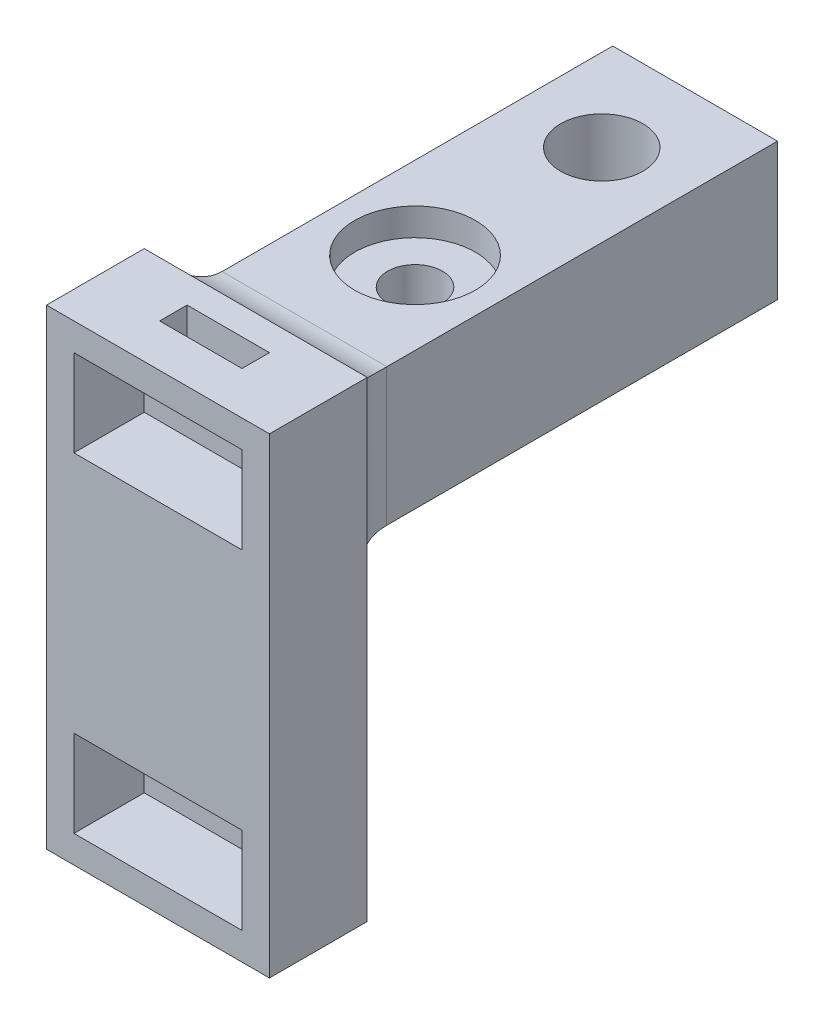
ISO-10303-21;
HEADER;
FILE_DESCRIPTION(('STEP AP214'),'2;1');
FILE_NAME('part.step','',(''),(''),'','','');
FILE_SCHEMA(('AUTOMOTIVE_DESIGN { 1 0 10303 214 1 1 1 1 }'));
ENDSEC;
DATA;
#1=APPLICATION_CONTEXT('core data for automotive mechanical design processes');
#2=APPLICATION_PROTOCOL_DEFINITION('international standard','automotive_design',2000,#1);
#3=PRODUCT_CONTEXT('',#1,'mechanical');
#4=PRODUCT('Part','Part','',(#3));
#5=PRODUCT_RELATED_PRODUCT_CATEGORY('part','',(#4));
#6=PRODUCT_DEFINITION_FORMATION('','',#4);
#7=PRODUCT_DEFINITION_CONTEXT('part definition',#1,'design');
#8=PRODUCT_DEFINITION('design','',#6,#7);
#9=PRODUCT_DEFINITION_SHAPE('','',#8);
#10=(LENGTH_UNIT() NAMED_UNIT(*) SI_UNIT(.MILLI.,.METRE.));
#11=(NAMED_UNIT(*) PLANE_ANGLE_UNIT() SI_UNIT($,.RADIAN.));
#12=(NAMED_UNIT(*) SI_UNIT($,.STERADIAN.) SOLID_ANGLE_UNIT());
#13=UNCERTAINTY_MEASURE_WITH_UNIT(LENGTH_MEASURE(1.E-05),#10,'distance_accuracy_value','');
#14=(GEOMETRIC_REPRESENTATION_CONTEXT(3) GLOBAL_UNCERTAINTY_ASSIGNED_CONTEXT((#13)) GLOBAL_UNIT_ASSIGNED_CONTEXT((#10,
#11,#12)) REPRESENTATION_CONTEXT('',''));
#15=CARTESIAN_POINT('',(0.,0.,0.));
#16=DIRECTION('',(0.,0.,1.));
#17=DIRECTION('',(1.,0.,0.));
#18=AXIS2_PLACEMENT_3D('',#15,#16,#17);
#19=CARTESIAN_POINT('',(0.,-42.5,-29.));
#20=DIRECTION('',(0.,1.,0.));
#21=DIRECTION('',(0.,0.,1.));
#22=AXIS2_PLACEMENT_3D('',#19,#20,#21);
#23=CYLINDRICAL_SURFACE('',#22,5.);
#24=CARTESIAN_POINT('',(0.,12.5,-29.));
#25=DIRECTION('',(0.,1.,0.));
#26=DIRECTION('',(-1.,0.,0.));
#27=AXIS2_PLACEMENT_3D('',#24,#25,#26);
#28=CIRCLE('',#27,5.);
#29=CARTESIAN_POINT('',(-5.,12.5,-29.));
#30=VERTEX_POINT('',#29);
#31=EDGE_CURVE('E312',#30,#30,#28,.T.);
#32=ORIENTED_EDGE('',*,*,#31,.F.);
#33=EDGE_LOOP('',(#32));
#34=FACE_BOUND('',#33,.T.);
#35=CARTESIAN_POINT('',(0.,32.5,-29.));
#36=DIRECTION('',(0.,1.,0.));
#37=DIRECTION('',(0.,0.,1.));
#38=AXIS2_PLACEMENT_3D('',#35,#36,#37);
#39=CIRCLE('',#38,5.);
#40=CARTESIAN_POINT('',(0.,32.5,-24.));
#41=VERTEX_POINT('',#40);
#42=EDGE_CURVE('E518',#41,#41,#39,.T.);
#43=ORIENTED_EDGE('',*,*,#42,.T.);
#44=EDGE_LOOP('',(#43));
#45=FACE_BOUND('',#44,.T.);
#46=ADVANCED_FACE('F43',(#34,#45),#23,.F.);
#47=CARTESIAN_POINT('',(0.,0.,0.));
#48=DIRECTION('',(0.,0.,-1.));
#49=DIRECTION('',(-1.,0.,0.));
#50=AXIS2_PLACEMENT_3D('',#47,#48,#49);
#51=PLANE('',#50);
#52=DIRECTION('',(-1.,0.,0.));
#53=VECTOR('',#52,1.);
#54=CARTESIAN_POINT('',(15.,12.5,0.));
#55=LINE('',#54,#53);
#56=CARTESIAN_POINT('',(20.3,12.5,0.));
#57=VERTEX_POINT('',#56);
#58=CARTESIAN_POINT('',(-20.3,12.5,0.));
#59=VERTEX_POINT('',#58);
#60=EDGE_CURVE('E316',#57,#59,#55,.T.);
#61=ORIENTED_EDGE('',*,*,#60,.F.);
#62=DIRECTION('',(0.,1.,0.));
#63=VECTOR('',#62,1.);
#64=CARTESIAN_POINT('',(20.3,-42.9,0.));
#65=LINE('',#64,#63);
#66=CARTESIAN_POINT('',(20.3,-42.9,0.));
#67=VERTEX_POINT('',#66);
#68=EDGE_CURVE('E287',#67,#57,#65,.T.);
#69=ORIENTED_EDGE('',*,*,#68,.F.);
#70=DIRECTION('',(1.,0.,0.));
#71=VECTOR('',#70,1.);
#72=CARTESIAN_POINT('',(-20.3,-42.9,0.));
#73=LINE('',#72,#71);
#74=CARTESIAN_POINT('',(-20.3,-42.9,0.));
#75=VERTEX_POINT('',#74);
#76=EDGE_CURVE('E280',#75,#67,#73,.T.);
#77=ORIENTED_EDGE('',*,*,#76,.F.);
#78=DIRECTION('',(0.,-1.,0.));
#79=VECTOR('',#78,1.);
#80=CARTESIAN_POINT('',(-20.3,-42.9,0.));
#81=LINE('',#80,#79);
#82=EDGE_CURVE('E292',#59,#75,#81,.T.);
#83=ORIENTED_EDGE('',*,*,#82,.F.);
#84=EDGE_LOOP('',(#61,#69,#77,#83));
#85=FACE_BOUND('',#84,.T.);
#86=ADVANCED_FACE('F354',(#85),#51,.T.);
#87=CARTESIAN_POINT('',(0.,0.,17.8));
#88=DIRECTION('',(0.,0.,-1.));
#89=DIRECTION('',(-1.,0.,0.));
#90=AXIS2_PLACEMENT_3D('',#87,#88,#89);
#91=PLANE('',#90);
#92=DIRECTION('',(0.,1.,0.));
#93=VECTOR('',#92,1.);
#94=CARTESIAN_POINT('',(15.3,-22.1,17.8));
#95=LINE('',#94,#93);
#96=CARTESIAN_POINT('',(15.3,-37.9,17.8));
#97=VERTEX_POINT('',#96);
#98=CARTESIAN_POINT('',(15.3,-22.1,17.8));
#99=VERTEX_POINT('',#98);
#100=EDGE_CURVE('E255',#97,#99,#95,.T.);
#101=ORIENTED_EDGE('',*,*,#100,.F.);
#102=DIRECTION('',(1.,0.,0.));
#103=VECTOR('',#102,1.);
#104=CARTESIAN_POINT('',(-15.3,-37.9,17.8));
#105=LINE('',#104,#103);
#106=CARTESIAN_POINT('',(-15.3,-37.9,17.8));
#107=VERTEX_POINT('',#106);
#108=EDGE_CURVE('E262',#107,#97,#105,.T.);
#109=ORIENTED_EDGE('',*,*,#108,.F.);
#110=DIRECTION('',(0.,-1.,0.));
#111=VECTOR('',#110,1.);
#112=CARTESIAN_POINT('',(-15.3,-22.1,17.8));
#113=LINE('',#112,#111);
#114=CARTESIAN_POINT('',(-15.3,-22.1,17.8));
#115=VERTEX_POINT('',#114);
#116=EDGE_CURVE('E259',#115,#107,#113,.T.);
#117=ORIENTED_EDGE('',*,*,#116,.F.);
#118=DIRECTION('',(-1.,0.,0.));
#119=VECTOR('',#118,1.);
#120=CARTESIAN_POINT('',(-15.3,-22.1,17.8));
#121=LINE('',#120,#119);
#122=EDGE_CURVE('E257',#99,#115,#121,.T.);
#123=ORIENTED_EDGE('',*,*,#122,.F.);
#124=EDGE_LOOP('',(#101,#109,#117,#123));
#125=FACE_BOUND('',#124,.T.);
#126=DIRECTION('',(0.,1.,0.));
#127=VECTOR('',#126,1.);
#128=CARTESIAN_POINT('',(20.3,-42.9,17.8));
#129=LINE('',#128,#127);
#130=CARTESIAN_POINT('',(20.3,-42.9,17.8));
#131=VERTEX_POINT('',#130);
#132=CARTESIAN_POINT('',(20.3,42.9,17.8));
#133=VERTEX_POINT('',#132);
#134=EDGE_CURVE('E276',#131,#133,#129,.T.);
#135=ORIENTED_EDGE('',*,*,#134,.T.);
#136=DIRECTION('',(-1.,0.,0.));
#137=VECTOR('',#136,1.);
#138=CARTESIAN_POINT('',(-20.3,42.9,17.8));
#139=LINE('',#138,#137);
#140=CARTESIAN_POINT('',(-20.3,42.9,17.8));
#141=VERTEX_POINT('',#140);
#142=EDGE_CURVE('E279',#133,#141,#139,.T.);
#143=ORIENTED_EDGE('',*,*,#142,.T.);
#144=DIRECTION('',(0.,-1.,0.));
#145=VECTOR('',#144,1.);
#146=CARTESIAN_POINT('',(-20.3,-42.9,17.8));
#147=LINE('',#146,#145);
#148=CARTESIAN_POINT('',(-20.3,-42.9,17.8));
#149=VERTEX_POINT('',#148);
#150=EDGE_CURVE('E282',#141,#149,#147,.T.);
#151=ORIENTED_EDGE('',*,*,#150,.T.);
#152=DIRECTION('',(1.,0.,0.));
#153=VECTOR('',#152,1.);
#154=CARTESIAN_POINT('',(-20.3,-42.9,17.8));
#155=LINE('',#154,#153);
#156=EDGE_CURVE('E284',#149,#131,#155,.T.);
#157=ORIENTED_EDGE('',*,*,#156,.T.);
#158=EDGE_LOOP('',(#135,#143,#151,#157));
#159=FACE_BOUND('',#158,.T.);
#160=DIRECTION('',(0.,-1.,0.));
#161=VECTOR('',#160,1.);
#162=CARTESIAN_POINT('',(-15.3,22.1,17.8));
#163=LINE('',#162,#161);
#164=CARTESIAN_POINT('',(-15.3,37.9,17.8));
#165=VERTEX_POINT('',#164);
#166=CARTESIAN_POINT('',(-15.3,22.1,17.8));
#167=VERTEX_POINT('',#166);
#168=EDGE_CURVE('E236',#165,#167,#163,.T.);
#169=ORIENTED_EDGE('',*,*,#168,.F.);
#170=DIRECTION('',(-1.,0.,0.));
#171=VECTOR('',#170,1.);
#172=CARTESIAN_POINT('',(-15.3,37.9,17.8));
#173=LINE('',#172,#171);
#174=CARTESIAN_POINT('',(15.3,37.9,17.8));
#175=VERTEX_POINT('',#174);
#176=EDGE_CURVE('E243',#175,#165,#173,.T.);
#177=ORIENTED_EDGE('',*,*,#176,.F.);
#178=DIRECTION('',(0.,1.,0.));
#179=VECTOR('',#178,1.);
#180=CARTESIAN_POINT('',(15.3,22.1,17.8));
#181=LINE('',#180,#179);
#182=CARTESIAN_POINT('',(15.3,22.1,17.8));
#183=VERTEX_POINT('',#182);
#184=EDGE_CURVE('E240',#183,#175,#181,.T.);
#185=ORIENTED_EDGE('',*,*,#184,.F.);
#186=DIRECTION('',(1.,0.,0.));
#187=VECTOR('',#186,1.);
#188=CARTESIAN_POINT('',(-15.3,22.1,17.8));
#189=LINE('',#188,#187);
#190=EDGE_CURVE('E238',#167,#183,#189,.T.);
#191=ORIENTED_EDGE('',*,*,#190,.F.);
#192=EDGE_LOOP('',(#169,#177,#185,#191));
#193=FACE_BOUND('',#192,.T.);
#194=ADVANCED_FACE('F360',(#125,#159,#193),#91,.F.);
#195=CARTESIAN_POINT('',(20.3,-42.9,17.8));
#196=DIRECTION('',(-1.,0.,0.));
#197=DIRECTION('',(0.,0.,1.));
#198=AXIS2_PLACEMENT_3D('',#195,#196,#197);
#199=PLANE('',#198);
#200=ORIENTED_EDGE('',*,*,#68,.T.);
#201=CARTESIAN_POINT('',(20.3,42.9,0.));
#202=VERTEX_POINT('',#201);
#203=EDGE_CURVE('E275',#57,#202,#65,.T.);
#204=ORIENTED_EDGE('',*,*,#203,.T.);
#205=DIRECTION('',(0.,0.,-1.));
#206=VECTOR('',#205,1.);
#207=CARTESIAN_POINT('',(20.3,42.9,17.8));
#208=LINE('',#207,#206);
#209=EDGE_CURVE('E305',#133,#202,#208,.T.);
#210=ORIENTED_EDGE('',*,*,#209,.F.);
#211=ORIENTED_EDGE('',*,*,#134,.F.);
#212=DIRECTION('',(0.,0.,-1.));
#213=VECTOR('',#212,1.);
#214=CARTESIAN_POINT('',(20.3,-42.9,17.8));
#215=LINE('',#214,#213);
#216=EDGE_CURVE('E286',#131,#67,#215,.T.);
#217=ORIENTED_EDGE('',*,*,#216,.T.);
#218=EDGE_LOOP('',(#200,#204,#210,#211,#217));
#219=FACE_BOUND('',#218,.T.);
#220=ADVANCED_FACE('F431',(#219),#199,.F.);
#221=CARTESIAN_POINT('',(-20.3,42.9,17.8));
#222=DIRECTION('',(0.,-1.,0.));
#223=DIRECTION('',(0.,0.,-1.));
#224=AXIS2_PLACEMENT_3D('',#221,#222,#223);
#225=PLANE('',#224);
#226=DIRECTION('',(-1.,0.,0.));
#227=VECTOR('',#226,1.);
#228=CARTESIAN_POINT('',(-7.5,42.9,5.));
#229=LINE('',#228,#227);
#230=CARTESIAN_POINT('',(7.5,42.9,5.));
#231=VERTEX_POINT('',#230);
#232=CARTESIAN_POINT('',(-7.5,42.9,5.));
#233=VERTEX_POINT('',#232);
#234=EDGE_CURVE('E507',#231,#233,#229,.T.);
#235=ORIENTED_EDGE('',*,*,#234,.F.);
#236=DIRECTION('',(0.,0.,-1.));
#237=VECTOR('',#236,1.);
#238=CARTESIAN_POINT('',(7.5,42.9,10.));
#239=LINE('',#238,#237);
#240=CARTESIAN_POINT('',(7.5,42.9,10.));
#241=VERTEX_POINT('',#240);
#242=EDGE_CURVE('E65',#241,#231,#239,.T.);
#243=ORIENTED_EDGE('',*,*,#242,.F.);
#244=DIRECTION('',(1.,0.,0.));
#245=VECTOR('',#244,1.);
#246=CARTESIAN_POINT('',(-7.5,42.9,10.));
#247=LINE('',#246,#245);
#248=CARTESIAN_POINT('',(-7.5,42.9,10.));
#249=VERTEX_POINT('',#248);
#250=EDGE_CURVE('E213',#249,#241,#247,.T.);
#251=ORIENTED_EDGE('',*,*,#250,.F.);
#252=DIRECTION('',(0.,0.,1.));
#253=VECTOR('',#252,1.);
#254=CARTESIAN_POINT('',(-7.5,42.9,10.));
#255=LINE('',#254,#253);
#256=EDGE_CURVE('E509',#233,#249,#255,.T.);
#257=ORIENTED_EDGE('',*,*,#256,.F.);
#258=EDGE_LOOP('',(#235,#243,#251,#257));
#259=FACE_BOUND('',#258,.T.);
#260=DIRECTION('',(-1.,0.,0.));
#261=VECTOR('',#260,1.);
#262=CARTESIAN_POINT('',(-20.3,42.9,0.));
#263=LINE('',#262,#261);
#264=CARTESIAN_POINT('',(-20.3,42.9,0.));
#265=VERTEX_POINT('',#264);
#266=EDGE_CURVE('E290',#202,#265,#263,.T.);
#267=ORIENTED_EDGE('',*,*,#266,.T.);
#268=DIRECTION('',(0.,0.,-1.));
#269=VECTOR('',#268,1.);
#270=CARTESIAN_POINT('',(-20.3,42.9,17.8));
#271=LINE('',#270,#269);
#272=EDGE_CURVE('E302',#141,#265,#271,.T.);
#273=ORIENTED_EDGE('',*,*,#272,.F.);
#274=ORIENTED_EDGE('',*,*,#142,.F.);
#275=ORIENTED_EDGE('',*,*,#209,.T.);
#276=EDGE_LOOP('',(#267,#273,#274,#275));
#277=FACE_BOUND('',#276,.T.);
#278=ADVANCED_FACE('F440',(#259,#277),#225,.F.);
#279=CARTESIAN_POINT('',(-20.3,-42.9,17.8));
#280=DIRECTION('',(1.,0.,0.));
#281=DIRECTION('',(0.,0.,-1.));
#282=AXIS2_PLACEMENT_3D('',#279,#280,#281);
#283=PLANE('',#282);
#284=EDGE_CURVE('E293',#265,#59,#81,.T.);
#285=ORIENTED_EDGE('',*,*,#284,.T.);
#286=ORIENTED_EDGE('',*,*,#82,.T.);
#287=DIRECTION('',(0.,0.,-1.));
#288=VECTOR('',#287,1.);
#289=CARTESIAN_POINT('',(-20.3,-42.9,17.8));
#290=LINE('',#289,#288);
#291=EDGE_CURVE('E299',#149,#75,#290,.T.);
#292=ORIENTED_EDGE('',*,*,#291,.F.);
#293=ORIENTED_EDGE('',*,*,#150,.F.);
#294=ORIENTED_EDGE('',*,*,#272,.T.);
#295=EDGE_LOOP('',(#285,#286,#292,#293,#294));
#296=FACE_BOUND('',#295,.T.);
#297=ADVANCED_FACE('F436',(#296),#283,.F.);
#298=CARTESIAN_POINT('',(-20.3,-42.9,17.8));
#299=DIRECTION('',(0.,1.,0.));
#300=DIRECTION('',(0.,0.,1.));
#301=AXIS2_PLACEMENT_3D('',#298,#299,#300);
#302=PLANE('',#301);
#303=ORIENTED_EDGE('',*,*,#76,.T.);
#304=ORIENTED_EDGE('',*,*,#216,.F.);
#305=ORIENTED_EDGE('',*,*,#156,.F.);
#306=ORIENTED_EDGE('',*,*,#291,.T.);
#307=EDGE_LOOP('',(#303,#304,#305,#306));
#308=FACE_BOUND('',#307,.T.);
#309=ADVANCED_FACE('F428',(#308),#302,.F.);
#310=CARTESIAN_POINT('',(15.3,-22.1,17.8));
#311=DIRECTION('',(-1.,0.,0.));
#312=DIRECTION('',(0.,0.,1.));
#313=AXIS2_PLACEMENT_3D('',#310,#311,#312);
#314=PLANE('',#313);
#315=DIRECTION('',(0.,-1.,0.));
#316=VECTOR('',#315,1.);
#317=CARTESIAN_POINT('',(15.3,-37.9,5.));
#318=LINE('',#317,#316);
#319=CARTESIAN_POINT('',(15.3,-22.1,5.));
#320=VERTEX_POINT('',#319);
#321=CARTESIAN_POINT('',(15.3,-37.9,5.));
#322=VERTEX_POINT('',#321);
#323=EDGE_CURVE('E233',#320,#322,#318,.T.);
#324=ORIENTED_EDGE('',*,*,#323,.T.);
#325=DIRECTION('',(0.,0.,-1.));
#326=VECTOR('',#325,1.);
#327=CARTESIAN_POINT('',(15.3,-37.9,17.8));
#328=LINE('',#327,#326);
#329=EDGE_CURVE('E264',#97,#322,#328,.T.);
#330=ORIENTED_EDGE('',*,*,#329,.F.);
#331=ORIENTED_EDGE('',*,*,#100,.T.);
#332=DIRECTION('',(0.,0.,-1.));
#333=VECTOR('',#332,1.);
#334=CARTESIAN_POINT('',(15.3,-22.1,17.8));
#335=LINE('',#334,#333);
#336=EDGE_CURVE('E272',#99,#320,#335,.T.);
#337=ORIENTED_EDGE('',*,*,#336,.T.);
#338=EDGE_LOOP('',(#324,#330,#331,#337));
#339=FACE_BOUND('',#338,.T.);
#340=ADVANCED_FACE('F424',(#339),#314,.T.);
#341=CARTESIAN_POINT('',(-15.3,-22.1,17.8));
#342=DIRECTION('',(0.,-1.,0.));
#343=DIRECTION('',(0.,0.,-1.));
#344=AXIS2_PLACEMENT_3D('',#341,#342,#343);
#345=PLANE('',#344);
#346=DIRECTION('',(1.,0.,0.));
#347=VECTOR('',#346,1.);
#348=CARTESIAN_POINT('',(15.3,-22.1,5.));
#349=LINE('',#348,#347);
#350=CARTESIAN_POINT('',(-15.3,-22.1,5.));
#351=VERTEX_POINT('',#350);
#352=EDGE_CURVE('E231',#351,#320,#349,.T.);
#353=ORIENTED_EDGE('',*,*,#352,.T.);
#354=ORIENTED_EDGE('',*,*,#336,.F.);
#355=ORIENTED_EDGE('',*,*,#122,.T.);
#356=DIRECTION('',(0.,0.,-1.));
#357=VECTOR('',#356,1.);
#358=CARTESIAN_POINT('',(-15.3,-22.1,17.8));
#359=LINE('',#358,#357);
#360=EDGE_CURVE('E269',#115,#351,#359,.T.);
#361=ORIENTED_EDGE('',*,*,#360,.T.);
#362=EDGE_LOOP('',(#353,#354,#355,#361));
#363=FACE_BOUND('',#362,.T.);
#364=ADVANCED_FACE('F420',(#363),#345,.T.);
#365=CARTESIAN_POINT('',(-15.3,-22.1,17.8));
#366=DIRECTION('',(1.,0.,0.));
#367=DIRECTION('',(0.,1.,0.));
#368=AXIS2_PLACEMENT_3D('',#365,#366,#367);
#369=PLANE('',#368);
#370=DIRECTION('',(0.,1.,0.));
#371=VECTOR('',#370,1.);
#372=CARTESIAN_POINT('',(-15.3,-22.1,5.));
#373=LINE('',#372,#371);
#374=CARTESIAN_POINT('',(-15.3,-37.9,5.));
#375=VERTEX_POINT('',#374);
#376=EDGE_CURVE('E229',#375,#351,#373,.T.);
#377=ORIENTED_EDGE('',*,*,#376,.T.);
#378=ORIENTED_EDGE('',*,*,#360,.F.);
#379=ORIENTED_EDGE('',*,*,#116,.T.);
#380=DIRECTION('',(0.,0.,-1.));
#381=VECTOR('',#380,1.);
#382=CARTESIAN_POINT('',(-15.3,-37.9,17.8));
#383=LINE('',#382,#381);
#384=EDGE_CURVE('E266',#107,#375,#383,.T.);
#385=ORIENTED_EDGE('',*,*,#384,.T.);
#386=EDGE_LOOP('',(#377,#378,#379,#385));
#387=FACE_BOUND('',#386,.T.);
#388=ADVANCED_FACE('F416',(#387),#369,.T.);
#389=CARTESIAN_POINT('',(-15.3,-37.9,17.8));
#390=DIRECTION('',(0.,1.,0.));
#391=DIRECTION('',(0.,0.,1.));
#392=AXIS2_PLACEMENT_3D('',#389,#390,#391);
#393=PLANE('',#392);
#394=DIRECTION('',(-1.,0.,0.));
#395=VECTOR('',#394,1.);
#396=CARTESIAN_POINT('',(-15.3,-37.9,5.));
#397=LINE('',#396,#395);
#398=EDGE_CURVE('E223',#322,#375,#397,.T.);
#399=ORIENTED_EDGE('',*,*,#398,.T.);
#400=ORIENTED_EDGE('',*,*,#384,.F.);
#401=ORIENTED_EDGE('',*,*,#108,.T.);
#402=ORIENTED_EDGE('',*,*,#329,.T.);
#403=EDGE_LOOP('',(#399,#400,#401,#402));
#404=FACE_BOUND('',#403,.T.);
#405=ADVANCED_FACE('F412',(#404),#393,.T.);
#406=CARTESIAN_POINT('',(-15.3,22.1,17.8));
#407=DIRECTION('',(1.,0.,0.));
#408=DIRECTION('',(0.,1.,0.));
#409=AXIS2_PLACEMENT_3D('',#406,#407,#408);
#410=PLANE('',#409);
#411=DIRECTION('',(0.,1.,0.));
#412=VECTOR('',#411,1.);
#413=CARTESIAN_POINT('',(-15.3,37.9,5.));
#414=LINE('',#413,#412);
#415=CARTESIAN_POINT('',(-15.3,22.1,5.));
#416=VERTEX_POINT('',#415);
#417=CARTESIAN_POINT('',(-15.3,37.9,5.));
#418=VERTEX_POINT('',#417);
#419=EDGE_CURVE('E492',#416,#418,#414,.T.);
#420=ORIENTED_EDGE('',*,*,#419,.T.);
#421=DIRECTION('',(0.,0.,-1.));
#422=VECTOR('',#421,1.);
#423=CARTESIAN_POINT('',(-15.3,37.9,17.8));
#424=LINE('',#423,#422);
#425=EDGE_CURVE('E245',#165,#418,#424,.T.);
#426=ORIENTED_EDGE('',*,*,#425,.F.);
#427=ORIENTED_EDGE('',*,*,#168,.T.);
#428=DIRECTION('',(0.,0.,-1.));
#429=VECTOR('',#428,1.);
#430=CARTESIAN_POINT('',(-15.3,22.1,17.8));
#431=LINE('',#430,#429);
#432=EDGE_CURVE('E252',#167,#416,#431,.T.);
#433=ORIENTED_EDGE('',*,*,#432,.T.);
#434=EDGE_LOOP('',(#420,#426,#427,#433));
#435=FACE_BOUND('',#434,.T.);
#436=ADVANCED_FACE('F408',(#435),#410,.T.);
#437=CARTESIAN_POINT('',(-15.3,22.1,17.8));
#438=DIRECTION('',(0.,1.,0.));
#439=DIRECTION('',(0.,0.,1.));
#440=AXIS2_PLACEMENT_3D('',#437,#438,#439);
#441=PLANE('',#440);
#442=DIRECTION('',(-1.,0.,0.));
#443=VECTOR('',#442,1.);
#444=CARTESIAN_POINT('',(-15.3,22.1,5.));
#445=LINE('',#444,#443);
#446=CARTESIAN_POINT('',(15.3,22.1,5.));
#447=VERTEX_POINT('',#446);
#448=EDGE_CURVE('E224',#447,#416,#445,.T.);
#449=ORIENTED_EDGE('',*,*,#448,.T.);
#450=ORIENTED_EDGE('',*,*,#432,.F.);
#451=ORIENTED_EDGE('',*,*,#190,.T.);
#452=DIRECTION('',(0.,0.,-1.));
#453=VECTOR('',#452,1.);
#454=CARTESIAN_POINT('',(15.3,22.1,17.8));
#455=LINE('',#454,#453);
#456=EDGE_CURVE('E249',#183,#447,#455,.T.);
#457=ORIENTED_EDGE('',*,*,#456,.T.);
#458=EDGE_LOOP('',(#449,#450,#451,#457));
#459=FACE_BOUND('',#458,.T.);
#460=ADVANCED_FACE('F404',(#459),#441,.T.);
#461=CARTESIAN_POINT('',(15.3,22.1,17.8));
#462=DIRECTION('',(-1.,0.,0.));
#463=DIRECTION('',(0.,0.,1.));
#464=AXIS2_PLACEMENT_3D('',#461,#462,#463);
#465=PLANE('',#464);
#466=DIRECTION('',(0.,-1.,0.));
#467=VECTOR('',#466,1.);
#468=CARTESIAN_POINT('',(15.3,22.1,5.));
#469=LINE('',#468,#467);
#470=CARTESIAN_POINT('',(15.3,37.9,5.));
#471=VERTEX_POINT('',#470);
#472=EDGE_CURVE('E219',#471,#447,#469,.T.);
#473=ORIENTED_EDGE('',*,*,#472,.T.);
#474=ORIENTED_EDGE('',*,*,#456,.F.);
#475=ORIENTED_EDGE('',*,*,#184,.T.);
#476=DIRECTION('',(0.,0.,-1.));
#477=VECTOR('',#476,1.);
#478=CARTESIAN_POINT('',(15.3,37.9,17.8));
#479=LINE('',#478,#477);
#480=EDGE_CURVE('E247',#175,#471,#479,.T.);
#481=ORIENTED_EDGE('',*,*,#480,.T.);
#482=EDGE_LOOP('',(#473,#474,#475,#481));
#483=FACE_BOUND('',#482,.T.);
#484=ADVANCED_FACE('F401',(#483),#465,.T.);
#485=CARTESIAN_POINT('',(-15.3,37.9,17.8));
#486=DIRECTION('',(0.,-1.,0.));
#487=DIRECTION('',(0.,0.,-1.));
#488=AXIS2_PLACEMENT_3D('',#485,#486,#487);
#489=PLANE('',#488);
#490=DIRECTION('',(0.,0.,-1.));
#491=VECTOR('',#490,1.);
#492=CARTESIAN_POINT('',(7.5,37.9,10.));
#493=LINE('',#492,#491);
#494=CARTESIAN_POINT('',(7.5,37.9,10.));
#495=VERTEX_POINT('',#494);
#496=CARTESIAN_POINT('',(7.5,37.9,5.));
#497=VERTEX_POINT('',#496);
#498=EDGE_CURVE('E199',#495,#497,#493,.T.);
#499=ORIENTED_EDGE('',*,*,#498,.T.);
#500=DIRECTION('',(1.,0.,0.));
#501=VECTOR('',#500,1.);
#502=CARTESIAN_POINT('',(15.3,37.9,5.));
#503=LINE('',#502,#501);
#504=EDGE_CURVE('E210',#497,#471,#503,.T.);
#505=ORIENTED_EDGE('',*,*,#504,.T.);
#506=ORIENTED_EDGE('',*,*,#480,.F.);
#507=ORIENTED_EDGE('',*,*,#176,.T.);
#508=ORIENTED_EDGE('',*,*,#425,.T.);
#509=CARTESIAN_POINT('',(-7.5,37.9,5.));
#510=VERTEX_POINT('',#509);
#511=EDGE_CURVE('E220',#418,#510,#503,.T.);
#512=ORIENTED_EDGE('',*,*,#511,.T.);
#513=DIRECTION('',(0.,0.,1.));
#514=VECTOR('',#513,1.);
#515=CARTESIAN_POINT('',(-7.5,37.9,10.));
#516=LINE('',#515,#514);
#517=CARTESIAN_POINT('',(-7.5,37.9,10.));
#518=VERTEX_POINT('',#517);
#519=EDGE_CURVE('E73',#510,#518,#516,.T.);
#520=ORIENTED_EDGE('',*,*,#519,.T.);
#521=DIRECTION('',(1.,0.,0.));
#522=VECTOR('',#521,1.);
#523=CARTESIAN_POINT('',(-7.5,37.9,10.));
#524=LINE('',#523,#522);
#525=EDGE_CURVE('E206',#518,#495,#524,.T.);
#526=ORIENTED_EDGE('',*,*,#525,.T.);
#527=EDGE_LOOP('',(#499,#505,#506,#507,#508,#512,#520,#526));
#528=FACE_BOUND('',#527,.T.);
#529=ADVANCED_FACE('F209',(#528),#489,.T.);
#530=CARTESIAN_POINT('',(0.,0.,5.));
#531=DIRECTION('',(0.,0.,1.));
#532=DIRECTION('',(1.,0.,0.));
#533=AXIS2_PLACEMENT_3D('',#530,#531,#532);
#534=PLANE('',#533);
#535=ORIENTED_EDGE('',*,*,#398,.F.);
#536=ORIENTED_EDGE('',*,*,#323,.F.);
#537=ORIENTED_EDGE('',*,*,#352,.F.);
#538=ORIENTED_EDGE('',*,*,#376,.F.);
#539=EDGE_LOOP('',(#535,#536,#537,#538));
#540=FACE_BOUND('',#539,.T.);
#541=ADVANCED_FACE('F395',(#540),#534,.T.);
#542=CARTESIAN_POINT('',(0.,0.,5.));
#543=DIRECTION('',(0.,0.,1.));
#544=DIRECTION('',(1.,0.,0.));
#545=AXIS2_PLACEMENT_3D('',#542,#543,#544);
#546=PLANE('',#545);
#547=ORIENTED_EDGE('',*,*,#511,.F.);
#548=ORIENTED_EDGE('',*,*,#419,.F.);
#549=ORIENTED_EDGE('',*,*,#448,.F.);
#550=ORIENTED_EDGE('',*,*,#472,.F.);
#551=ORIENTED_EDGE('',*,*,#504,.F.);
#552=DIRECTION('',(0.,1.,0.));
#553=VECTOR('',#552,1.);
#554=CARTESIAN_POINT('',(7.5,37.9,5.));
#555=LINE('',#554,#553);
#556=EDGE_CURVE('E196',#497,#231,#555,.T.);
#557=ORIENTED_EDGE('',*,*,#556,.T.);
#558=ORIENTED_EDGE('',*,*,#234,.T.);
#559=DIRECTION('',(0.,1.,0.));
#560=VECTOR('',#559,1.);
#561=CARTESIAN_POINT('',(-7.5,37.9,5.));
#562=LINE('',#561,#560);
#563=EDGE_CURVE('E205',#510,#233,#562,.T.);
#564=ORIENTED_EDGE('',*,*,#563,.F.);
#565=EDGE_LOOP('',(#547,#548,#549,#550,#551,#557,#558,#564));
#566=FACE_BOUND('',#565,.T.);
#567=ADVANCED_FACE('F217',(#566),#546,.T.);
#568=CARTESIAN_POINT('',(-15.,37.5,-80.));
#569=DIRECTION('',(1.,0.,0.));
#570=DIRECTION('',(0.,1.,0.));
#571=AXIS2_PLACEMENT_3D('',#568,#569,#570);
#572=PLANE('',#571);
#573=DIRECTION('',(0.,0.,1.));
#574=VECTOR('',#573,1.);
#575=CARTESIAN_POINT('',(-15.,12.5,-80.));
#576=LINE('',#575,#574);
#577=CARTESIAN_POINT('',(-15.,12.5,-80.));
#578=VERTEX_POINT('',#577);
#579=CARTESIAN_POINT('',(-15.,12.5,-8.82666414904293));
#580=VERTEX_POINT('',#579);
#581=EDGE_CURVE('E471',#578,#580,#576,.T.);
#582=ORIENTED_EDGE('',*,*,#581,.T.);
#583=DIRECTION('',(0.,-1.,0.));
#584=VECTOR('',#583,1.);
#585=CARTESIAN_POINT('',(-15.,37.5,-8.82666414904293));
#586=LINE('',#585,#584);
#587=CARTESIAN_POINT('',(-15.,37.5001379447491,-8.82666414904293));
#588=VERTEX_POINT('',#587);
#589=EDGE_CURVE('E319',#580,#588,#586,.F.);
#590=ORIENTED_EDGE('',*,*,#589,.T.);
#591=CARTESIAN_POINT('',(-15.,47.5,-8.87918915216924));
#592=DIRECTION('',(1.,0.,0.));
#593=DIRECTION('',(0.,1.,0.));
#594=AXIS2_PLACEMENT_3D('',#591,#592,#593);
#595=CIRCLE('',#594,10.);
#596=CARTESIAN_POINT('',(-15.,37.5,-8.87918915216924));
#597=VERTEX_POINT('',#596);
#598=EDGE_CURVE('E12',#588,#597,#595,.T.);
#599=ORIENTED_EDGE('',*,*,#598,.T.);
#600=DIRECTION('',(0.,0.,1.));
#601=VECTOR('',#600,1.);
#602=CARTESIAN_POINT('',(-15.,37.5,-80.));
#603=LINE('',#602,#601);
#604=CARTESIAN_POINT('',(-15.,37.5,-80.));
#605=VERTEX_POINT('',#604);
#606=EDGE_CURVE('E489',#605,#597,#603,.T.);
#607=ORIENTED_EDGE('',*,*,#606,.F.);
#608=DIRECTION('',(0.,1.,0.));
#609=VECTOR('',#608,1.);
#610=CARTESIAN_POINT('',(-15.,37.5,-80.));
#611=LINE('',#610,#609);
#612=EDGE_CURVE('E476',#578,#605,#611,.T.);
#613=ORIENTED_EDGE('',*,*,#612,.F.);
#614=EDGE_LOOP('',(#582,#590,#599,#607,#613));
#615=FACE_BOUND('',#614,.T.);
#616=ADVANCED_FACE('F388',(#615),#572,.F.);
#617=CARTESIAN_POINT('',(15.,37.5,-80.));
#618=DIRECTION('',(0.,-1.,0.));
#619=DIRECTION('',(0.,0.,-1.));
#620=AXIS2_PLACEMENT_3D('',#617,#618,#619);
#621=PLANE('',#620);
#622=CARTESIAN_POINT('',(0.,37.5,-29.));
#623=DIRECTION('',(0.,1.,0.));
#624=DIRECTION('',(0.,0.,1.));
#625=AXIS2_PLACEMENT_3D('',#622,#623,#624);
#626=CIRCLE('',#625,11.);
#627=CARTESIAN_POINT('',(0.,37.5,-18.));
#628=VERTEX_POINT('',#627);
#629=EDGE_CURVE('E521',#628,#628,#626,.T.);
#630=ORIENTED_EDGE('',*,*,#629,.F.);
#631=EDGE_LOOP('',(#630));
#632=FACE_BOUND('',#631,.T.);
#633=CARTESIAN_POINT('',(0.,37.5,-63.));
#634=DIRECTION('',(0.,1.,0.));
#635=DIRECTION('',(0.,0.,1.));
#636=AXIS2_PLACEMENT_3D('',#633,#634,#635);
#637=CIRCLE('',#636,7.5);
#638=CARTESIAN_POINT('',(0.,37.5,-55.5));
#639=VERTEX_POINT('',#638);
#640=EDGE_CURVE('E313',#639,#639,#637,.T.);
#641=ORIENTED_EDGE('',*,*,#640,.F.);
#642=EDGE_LOOP('',(#641));
#643=FACE_BOUND('',#642,.T.);
#644=ORIENTED_EDGE('',*,*,#606,.T.);
#645=DIRECTION('',(-1.,0.,0.));
#646=VECTOR('',#645,1.);
#647=CARTESIAN_POINT('',(15.,37.5,-8.87918915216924));
#648=LINE('',#647,#646);
#649=CARTESIAN_POINT('',(15.,37.5,-8.87918915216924));
#650=VERTEX_POINT('',#649);
#651=EDGE_CURVE('E321',#597,#650,#648,.F.);
#652=ORIENTED_EDGE('',*,*,#651,.T.);
#653=DIRECTION('',(0.,0.,1.));
#654=VECTOR('',#653,1.);
#655=CARTESIAN_POINT('',(15.,37.5,-80.));
#656=LINE('',#655,#654);
#657=CARTESIAN_POINT('',(15.,37.5,-80.));
#658=VERTEX_POINT('',#657);
#659=EDGE_CURVE('E481',#658,#650,#656,.T.);
#660=ORIENTED_EDGE('',*,*,#659,.F.);
#661=DIRECTION('',(1.,0.,0.));
#662=VECTOR('',#661,1.);
#663=CARTESIAN_POINT('',(15.,37.5,-80.));
#664=LINE('',#663,#662);
#665=EDGE_CURVE('E530',#605,#658,#664,.T.);
#666=ORIENTED_EDGE('',*,*,#665,.F.);
#667=EDGE_LOOP('',(#644,#652,#660,#666));
#668=FACE_BOUND('',#667,.T.);
#669=ADVANCED_FACE('F384',(#632,#643,#668),#621,.F.);
#670=CARTESIAN_POINT('',(15.,37.5,-80.));
#671=DIRECTION('',(-1.,0.,0.));
#672=DIRECTION('',(0.,-1.,0.));
#673=AXIS2_PLACEMENT_3D('',#670,#671,#672);
#674=PLANE('',#673);
#675=ORIENTED_EDGE('',*,*,#659,.T.);
#676=CARTESIAN_POINT('',(15.,47.5,-8.87918915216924));
#677=DIRECTION('',(-1.,0.,0.));
#678=DIRECTION('',(0.,-1.,0.));
#679=AXIS2_PLACEMENT_3D('',#676,#677,#678);
#680=CIRCLE('',#679,10.);
#681=CARTESIAN_POINT('',(15.,37.5001379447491,-8.82666414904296));
#682=VERTEX_POINT('',#681);
#683=EDGE_CURVE('E57',#650,#682,#680,.T.);
#684=ORIENTED_EDGE('',*,*,#683,.T.);
#685=DIRECTION('',(0.,1.,0.));
#686=VECTOR('',#685,1.);
#687=CARTESIAN_POINT('',(15.,37.5,-8.82666414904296));
#688=LINE('',#687,#686);
#689=CARTESIAN_POINT('',(15.,12.5,-8.82666414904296));
#690=VERTEX_POINT('',#689);
#691=EDGE_CURVE('E308',#682,#690,#688,.F.);
#692=ORIENTED_EDGE('',*,*,#691,.T.);
#693=DIRECTION('',(0.,0.,1.));
#694=VECTOR('',#693,1.);
#695=CARTESIAN_POINT('',(15.,12.5,-80.));
#696=LINE('',#695,#694);
#697=CARTESIAN_POINT('',(15.,12.5,-80.));
#698=VERTEX_POINT('',#697);
#699=EDGE_CURVE('E477',#698,#690,#696,.T.);
#700=ORIENTED_EDGE('',*,*,#699,.F.);
#701=DIRECTION('',(0.,-1.,0.));
#702=VECTOR('',#701,1.);
#703=CARTESIAN_POINT('',(15.,37.5,-80.));
#704=LINE('',#703,#702);
#705=EDGE_CURVE('E483',#658,#698,#704,.T.);
#706=ORIENTED_EDGE('',*,*,#705,.F.);
#707=EDGE_LOOP('',(#675,#684,#692,#700,#706));
#708=FACE_BOUND('',#707,.T.);
#709=ADVANCED_FACE('F380',(#708),#674,.F.);
#710=CARTESIAN_POINT('',(15.,12.5,-80.));
#711=DIRECTION('',(0.,1.,0.));
#712=DIRECTION('',(-1.,0.,0.));
#713=AXIS2_PLACEMENT_3D('',#710,#711,#712);
#714=PLANE('',#713);
#715=ORIENTED_EDGE('',*,*,#31,.T.);
#716=EDGE_LOOP('',(#715));
#717=FACE_BOUND('',#716,.T.);
#718=CARTESIAN_POINT('',(0.,12.5,-63.));
#719=DIRECTION('',(0.,1.,0.));
#720=DIRECTION('',(-1.,0.,0.));
#721=AXIS2_PLACEMENT_3D('',#718,#719,#720);
#722=CIRCLE('',#721,7.5);
#723=CARTESIAN_POINT('',(-7.5,12.5,-63.));
#724=VERTEX_POINT('',#723);
#725=EDGE_CURVE('E309',#724,#724,#722,.T.);
#726=ORIENTED_EDGE('',*,*,#725,.T.);
#727=EDGE_LOOP('',(#726));
#728=FACE_BOUND('',#727,.T.);
#729=ORIENTED_EDGE('',*,*,#60,.T.);
#730=CARTESIAN_POINT('',(-25.,12.5,-8.82666414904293));
#731=DIRECTION('',(0.,1.,0.));
#732=DIRECTION('',(-1.,0.,0.));
#733=AXIS2_PLACEMENT_3D('',#730,#731,#732);
#734=CIRCLE('',#733,10.);
#735=EDGE_CURVE('E326',#59,#580,#734,.T.);
#736=ORIENTED_EDGE('',*,*,#735,.T.);
#737=ORIENTED_EDGE('',*,*,#581,.F.);
#738=DIRECTION('',(-1.,0.,0.));
#739=VECTOR('',#738,1.);
#740=CARTESIAN_POINT('',(15.,12.5,-80.));
#741=LINE('',#740,#739);
#742=EDGE_CURVE('E478',#698,#578,#741,.T.);
#743=ORIENTED_EDGE('',*,*,#742,.F.);
#744=ORIENTED_EDGE('',*,*,#699,.T.);
#745=CARTESIAN_POINT('',(25.,12.5,-8.82666414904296));
#746=DIRECTION('',(0.,1.,0.));
#747=DIRECTION('',(-1.,0.,0.));
#748=AXIS2_PLACEMENT_3D('',#745,#746,#747);
#749=CIRCLE('',#748,10.);
#750=EDGE_CURVE('E323',#690,#57,#749,.T.);
#751=ORIENTED_EDGE('',*,*,#750,.T.);
#752=EDGE_LOOP('',(#729,#736,#737,#743,#744,#751));
#753=FACE_BOUND('',#752,.T.);
#754=ADVANCED_FACE('F376',(#717,#728,#753),#714,.F.);
#755=CARTESIAN_POINT('',(0.,0.,-80.));
#756=DIRECTION('',(0.,0.,-1.));
#757=DIRECTION('',(-1.,0.,0.));
#758=AXIS2_PLACEMENT_3D('',#755,#756,#757);
#759=PLANE('',#758);
#760=ORIENTED_EDGE('',*,*,#612,.T.);
#761=ORIENTED_EDGE('',*,*,#665,.T.);
#762=ORIENTED_EDGE('',*,*,#705,.T.);
#763=ORIENTED_EDGE('',*,*,#742,.T.);
#764=EDGE_LOOP('',(#760,#761,#762,#763));
#765=FACE_BOUND('',#764,.T.);
#766=ADVANCED_FACE('F372',(#765),#759,.T.);
#767=CARTESIAN_POINT('',(0.,-42.5,-63.));
#768=DIRECTION('',(0.,1.,0.));
#769=DIRECTION('',(0.,0.,1.));
#770=AXIS2_PLACEMENT_3D('',#767,#768,#769);
#771=CYLINDRICAL_SURFACE('',#770,7.5);
#772=ORIENTED_EDGE('',*,*,#640,.T.);
#773=EDGE_LOOP('',(#772));
#774=FACE_BOUND('',#773,.T.);
#775=ORIENTED_EDGE('',*,*,#725,.F.);
#776=EDGE_LOOP('',(#775));
#777=FACE_BOUND('',#776,.T.);
#778=ADVANCED_FACE('F369',(#774,#777),#771,.F.);
#779=CARTESIAN_POINT('',(0.,32.5,-29.));
#780=DIRECTION('',(0.,1.,0.));
#781=DIRECTION('',(0.,0.,1.));
#782=AXIS2_PLACEMENT_3D('',#779,#780,#781);
#783=CYLINDRICAL_SURFACE('',#782,11.);
#784=CARTESIAN_POINT('',(0.,32.5,-29.));
#785=DIRECTION('',(0.,1.,0.));
#786=DIRECTION('',(0.,0.,1.));
#787=AXIS2_PLACEMENT_3D('',#784,#785,#786);
#788=CIRCLE('',#787,11.);
#789=CARTESIAN_POINT('',(0.,32.5,-18.));
#790=VERTEX_POINT('',#789);
#791=EDGE_CURVE('E522',#790,#790,#788,.T.);
#792=ORIENTED_EDGE('',*,*,#791,.F.);
#793=EDGE_LOOP('',(#792));
#794=FACE_BOUND('',#793,.T.);
#795=ORIENTED_EDGE('',*,*,#629,.T.);
#796=EDGE_LOOP('',(#795));
#797=FACE_BOUND('',#796,.T.);
#798=ADVANCED_FACE('F367',(#794,#797),#783,.F.);
#799=CARTESIAN_POINT('',(0.,32.5,-29.));
#800=DIRECTION('',(0.,1.,0.));
#801=DIRECTION('',(0.,0.,1.));
#802=AXIS2_PLACEMENT_3D('',#799,#800,#801);
#803=PLANE('',#802);
#804=ORIENTED_EDGE('',*,*,#42,.F.);
#805=EDGE_LOOP('',(#804));
#806=FACE_BOUND('',#805,.T.);
#807=ORIENTED_EDGE('',*,*,#791,.T.);
#808=EDGE_LOOP('',(#807));
#809=FACE_BOUND('',#808,.T.);
#810=ADVANCED_FACE('F350',(#806,#809),#803,.T.);
#811=CARTESIAN_POINT('',(-25.,0.,-8.82666414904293));
#812=DIRECTION('',(0.,-1.,0.));
#813=DIRECTION('',(0.,0.,-1.));
#814=AXIS2_PLACEMENT_3D('',#811,#812,#813);
#815=CYLINDRICAL_SURFACE('',#814,10.);
#816=ORIENTED_EDGE('',*,*,#735,.F.);
#817=ORIENTED_EDGE('',*,*,#284,.F.);
#818=CARTESIAN_POINT('',(-15.,37.5001379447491,-8.82666414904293));
#819=CARTESIAN_POINT('',(-14.9999983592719,37.5007261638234,-8.71436498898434));
#820=CARTESIAN_POINT('',(-15.0018922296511,37.5032098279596,-8.60209334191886));
#821=CARTESIAN_POINT('',(-15.0094478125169,37.5119456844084,-8.37783084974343));
#822=CARTESIAN_POINT('',(-15.0151092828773,37.5181976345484,-8.26583998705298));
#823=CARTESIAN_POINT('',(-15.0376949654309,37.5425558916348,-7.93083884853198));
#824=CARTESIAN_POINT('',(-15.060220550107,37.5662659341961,-7.70856465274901));
#825=CARTESIAN_POINT('',(-15.1194572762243,37.6278725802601,-7.26991190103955));
#826=CARTESIAN_POINT('',(-15.156047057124,37.6656477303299,-7.05349941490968));
#827=CARTESIAN_POINT('',(-15.2426737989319,37.7546626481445,-6.62618371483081));
#828=CARTESIAN_POINT('',(-15.2927127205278,37.8059043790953,-6.41528130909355));
#829=CARTESIAN_POINT('',(-15.4051213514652,37.920738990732,-6.00102580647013));
#830=CARTESIAN_POINT('',(-15.4674518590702,37.9842925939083,-5.7976510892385));
#831=CARTESIAN_POINT('',(-15.6035337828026,38.1228531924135,-5.39871078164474));
#832=CARTESIAN_POINT('',(-15.6772895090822,38.197864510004,-5.20314817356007));
#833=CARTESIAN_POINT('',(-15.8352566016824,38.35838608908,-4.82036696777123));
#834=CARTESIAN_POINT('',(-15.9194839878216,38.443912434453,-4.63316176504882));
#835=CARTESIAN_POINT('',(-16.0972539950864,38.6243329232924,-4.26789327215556));
#836=CARTESIAN_POINT('',(-16.1907987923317,38.7192292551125,-4.08983213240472));
#837=CARTESIAN_POINT('',(-16.4262712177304,38.9580378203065,-3.67206580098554));
#838=CARTESIAN_POINT('',(-16.572308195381,39.1060917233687,-3.43702675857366));
#839=CARTESIAN_POINT('',(-16.8782631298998,39.4162537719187,-2.98614523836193));
#840=CARTESIAN_POINT('',(-17.0381823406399,39.5783631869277,-2.77030449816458));
#841=CARTESIAN_POINT('',(-17.3701477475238,39.9149469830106,-2.35705756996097));
#842=CARTESIAN_POINT('',(-17.5422294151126,40.0894575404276,-2.15970956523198));
#843=CARTESIAN_POINT('',(-17.8960895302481,40.4484852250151,-1.78386144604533));
#844=CARTESIAN_POINT('',(-18.077866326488,40.6330006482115,-1.60535813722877));
#845=CARTESIAN_POINT('',(-18.4244938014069,40.9851275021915,-1.28941813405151));
#846=CARTESIAN_POINT('',(-18.5883392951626,41.1516813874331,-1.14968571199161));
#847=CARTESIAN_POINT('',(-18.9211161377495,41.4902891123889,-0.883581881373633));
#848=CARTESIAN_POINT('',(-19.0900476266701,41.662343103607,-0.757210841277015));
#849=CARTESIAN_POINT('',(-19.430627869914,42.009685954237,-0.518537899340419));
#850=CARTESIAN_POINT('',(-19.6022396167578,42.1849330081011,-0.406121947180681));
#851=CARTESIAN_POINT('',(-19.9487957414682,42.5395182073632,-0.193786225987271));
#852=CARTESIAN_POINT('',(-20.123738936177,42.7188549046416,-0.0938621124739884));
#853=CARTESIAN_POINT('',(-20.3,42.9,0.));
#854=B_SPLINE_CURVE_WITH_KNOTS('',3,(#818,#819,#820,#821,#822,#823,#824,#825,#826,#827,#828,
#829,#830,#831,#832,#833,#834,#835,#836,#837,#838,#839,#840,#841,#842,#843,#844,#845,#846,#847,
#848,#849,#850,#851,#852,#853),.UNSPECIFIED.,.F.,.F.,(4,2,2,2,2,2,2,2,2,2,2,2,2,2,2,2,2,4),(0.,
0.336835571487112,0.673649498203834,1.34657410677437,2.01381785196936,2.68115892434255,
3.34640508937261,4.01190283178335,4.67843149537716,5.34511619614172,6.28520588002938,
7.22538056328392,8.16842040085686,9.1113001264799,9.92755857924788,10.7438395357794,
11.5529352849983,12.3617488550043),.UNSPECIFIED.);
#855=EDGE_CURVE('E48',#588,#265,#854,.T.);
#856=ORIENTED_EDGE('',*,*,#855,.F.);
#857=ORIENTED_EDGE('',*,*,#589,.F.);
#858=EDGE_LOOP('',(#816,#817,#856,#857));
#859=FACE_BOUND('',#858,.T.);
#860=ADVANCED_FACE('F45',(#859),#815,.F.);
#861=CARTESIAN_POINT('',(0.,47.5,-8.87918915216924));
#862=DIRECTION('',(-1.,0.,0.));
#863=DIRECTION('',(0.,0.,1.));
#864=AXIS2_PLACEMENT_3D('',#861,#862,#863);
#865=CYLINDRICAL_SURFACE('',#864,10.);
#866=ORIENTED_EDGE('',*,*,#855,.T.);
#867=ORIENTED_EDGE('',*,*,#266,.F.);
#868=CARTESIAN_POINT('',(31.4023865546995,41.0351130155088,-16.5084247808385));
#869=CARTESIAN_POINT('',(31.2721188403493,41.163238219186,-16.6169888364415));
#870=CARTESIAN_POINT('',(31.1400936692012,41.2930119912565,-16.721419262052));
#871=CARTESIAN_POINT('',(30.8728634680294,41.5554588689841,-16.9221829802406));
#872=CARTESIAN_POINT('',(30.7376590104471,41.6881314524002,-17.018517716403));
#873=CARTESIAN_POINT('',(30.327888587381,42.0897938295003,-17.2955674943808));
#874=CARTESIAN_POINT('',(30.0489928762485,42.3625982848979,-17.4644708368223));
#875=CARTESIAN_POINT('',(29.4830080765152,42.9141270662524,-17.7712622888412));
#876=CARTESIAN_POINT('',(29.1959581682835,43.1928218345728,-17.9092772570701));
#877=CARTESIAN_POINT('',(28.6136635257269,43.7543797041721,-18.1562700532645));
#878=CARTESIAN_POINT('',(28.3184204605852,44.0372419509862,-18.2652537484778));
#879=CARTESIAN_POINT('',(27.8313982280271,44.4969866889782,-18.4194610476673));
#880=CARTESIAN_POINT('',(27.6422889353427,44.6738788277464,-18.4732764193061));
#881=CARTESIAN_POINT('',(27.2596913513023,45.0259130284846,-18.570012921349));
#882=CARTESIAN_POINT('',(27.0662037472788,45.2010553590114,-18.6129357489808));
#883=CARTESIAN_POINT('',(26.7392974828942,45.4867665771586,-18.6751293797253));
#884=CARTESIAN_POINT('',(26.607897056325,45.5989871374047,-18.6974741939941));
#885=CARTESIAN_POINT('',(26.3400249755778,45.8183723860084,-18.737404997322));
#886=CARTESIAN_POINT('',(26.2035522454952,45.9255359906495,-18.7549899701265));
#887=CARTESIAN_POINT('',(25.9764688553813,46.0883542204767,-18.7792493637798));
#888=CARTESIAN_POINT('',(25.8887606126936,46.1477812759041,-18.7875027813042));
#889=CARTESIAN_POINT('',(25.707988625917,46.2585418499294,-18.8019834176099));
#890=CARTESIAN_POINT('',(25.6149275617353,46.3098793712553,-18.8082116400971));
#891=CARTESIAN_POINT('',(25.455833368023,46.3813391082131,-18.8164633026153));
#892=CARTESIAN_POINT('',(25.3919754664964,46.4060672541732,-18.8191942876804));
#893=CARTESIAN_POINT('',(25.2613093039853,46.4455605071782,-18.8234616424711));
#894=CARTESIAN_POINT('',(25.1945136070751,46.4603643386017,-18.8250026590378));
#895=CARTESIAN_POINT('',(25.058264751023,46.4769853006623,-18.8267281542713));
#896=CARTESIAN_POINT('',(24.988787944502,46.4786252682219,-18.8268941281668));
#897=CARTESIAN_POINT('',(24.850914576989,46.4679568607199,-18.8257917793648));
#898=CARTESIAN_POINT('',(24.7825198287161,46.455627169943,-18.8245212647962));
#899=CARTESIAN_POINT('',(24.6257964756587,46.4139530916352,-18.8200666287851));
#900=CARTESIAN_POINT('',(24.5387250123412,46.3802081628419,-18.8163737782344));
#901=CARTESIAN_POINT('',(24.3698749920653,46.3012024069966,-18.8071534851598));
#902=CARTESIAN_POINT('',(24.2881313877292,46.2558735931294,-18.8016151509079));
#903=CARTESIAN_POINT('',(24.1243965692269,46.1561222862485,-18.7886123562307));
#904=CARTESIAN_POINT('',(24.0426386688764,46.1013369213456,-18.7810587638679));
#905=CARTESIAN_POINT('',(23.8822351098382,45.9875748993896,-18.7643245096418));
#906=CARTESIAN_POINT('',(23.8035919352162,45.9285949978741,-18.755142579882));
#907=CARTESIAN_POINT('',(23.5705133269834,45.7476475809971,-18.7252110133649));
#908=CARTESIAN_POINT('',(23.4193127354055,45.6219314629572,-18.7021076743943));
#909=CARTESIAN_POINT('',(23.121068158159,45.3660134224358,-18.6497239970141));
#910=CARTESIAN_POINT('',(22.9740399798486,45.2357977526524,-18.6204230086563));
#911=CARTESIAN_POINT('',(22.6832840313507,44.9736336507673,-18.5557423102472));
#912=CARTESIAN_POINT('',(22.5395519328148,44.8416878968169,-18.5203711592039));
#913=CARTESIAN_POINT('',(22.1125859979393,44.4456314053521,-18.4052697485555));
#914=CARTESIAN_POINT('',(21.8326984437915,44.1805145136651,-18.3163942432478));
#915=CARTESIAN_POINT('',(21.2798870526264,43.6521691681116,-18.1136089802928));
#916=CARTESIAN_POINT('',(21.0069687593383,43.3889423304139,-17.9996799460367));
#917=CARTESIAN_POINT('',(20.4691827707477,42.8677045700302,-17.7462990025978));
#918=CARTESIAN_POINT('',(20.2043003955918,42.6096844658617,-17.6068973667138));
#919=CARTESIAN_POINT('',(19.6832781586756,42.1007416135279,-17.3015441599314));
#920=CARTESIAN_POINT('',(19.4271352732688,41.849816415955,-17.1356018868));
#921=CARTESIAN_POINT('',(18.9649800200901,41.3963014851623,-16.8045122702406));
#922=CARTESIAN_POINT('',(18.7574399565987,41.1923374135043,-16.6433795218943));
#923=CARTESIAN_POINT('',(18.3511679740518,40.7926875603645,-16.3008614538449));
#924=CARTESIAN_POINT('',(18.1524366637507,40.5970023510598,-16.1194747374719));
#925=CARTESIAN_POINT('',(17.7656925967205,40.215964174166,-15.7359983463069));
#926=CARTESIAN_POINT('',(17.577671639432,40.0306033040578,-15.533924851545));
#927=CARTESIAN_POINT('',(17.2142456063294,39.6722160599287,-15.1084072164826));
#928=CARTESIAN_POINT('',(17.0388418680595,39.4991909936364,-14.8849608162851));
#929=CARTESIAN_POINT('',(16.7425064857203,39.2068720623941,-14.4713533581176));
#930=CARTESIAN_POINT('',(16.6184296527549,39.0844761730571,-14.2856304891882));
#931=CARTESIAN_POINT('',(16.3805213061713,38.8498325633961,-13.9016586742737));
#932=CARTESIAN_POINT('',(16.2666872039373,38.7375822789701,-13.7034129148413));
#933=CARTESIAN_POINT('',(16.0507457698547,38.5247318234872,-13.2947975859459));
#934=CARTESIAN_POINT('',(15.9486317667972,38.4241250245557,-13.0844350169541));
#935=CARTESIAN_POINT('',(15.7576214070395,38.236070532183,-12.6521368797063));
#936=CARTESIAN_POINT('',(15.6687223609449,38.1486201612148,-12.4302036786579));
#937=CARTESIAN_POINT('',(15.5193731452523,38.0018854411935,-12.0138444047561));
#938=CARTESIAN_POINT('',(15.4566517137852,37.9403366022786,-11.8210286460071));
#939=CARTESIAN_POINT('',(15.3423779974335,37.8283845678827,-11.4289718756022));
#940=CARTESIAN_POINT('',(15.2908234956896,37.7779791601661,-11.2297321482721));
#941=CARTESIAN_POINT('',(15.1997911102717,37.6892255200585,-10.8263091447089));
#942=CARTESIAN_POINT('',(15.1602890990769,37.6508531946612,-10.6221366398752));
#943=CARTESIAN_POINT('',(15.093925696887,37.5867371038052,-10.2098653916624));
#944=CARTESIAN_POINT('',(15.0670583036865,37.5609873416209,-10.0017685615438));
#945=CARTESIAN_POINT('',(15.0312207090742,37.5271155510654,-9.63245482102));
#946=CARTESIAN_POINT('',(15.0195253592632,37.5162698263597,-9.47174300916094));
#947=CARTESIAN_POINT('',(15.0039134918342,37.502355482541,-9.14957530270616));
#948=CARTESIAN_POINT('',(14.9999985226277,37.4992884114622,-8.98811926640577));
#949=CARTESIAN_POINT('',(15.0000020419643,37.5013121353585,-8.60350740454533));
#950=CARTESIAN_POINT('',(15.007485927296,37.509968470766,-8.38035241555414));
#951=CARTESIAN_POINT('',(15.0372512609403,37.5420847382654,-7.93600686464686));
#952=CARTESIAN_POINT('',(15.0595410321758,37.5655529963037,-7.71481747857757));
#953=CARTESIAN_POINT('',(15.1184818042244,37.6268641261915,-7.27595161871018));
#954=CARTESIAN_POINT('',(15.1551601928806,37.6647344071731,-7.05828267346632));
#955=CARTESIAN_POINT('',(15.2421180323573,37.7540935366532,-6.62852334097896));
#956=CARTESIAN_POINT('',(15.292399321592,37.8055842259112,-6.41643371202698));
#957=CARTESIAN_POINT('',(15.4051877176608,37.9208067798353,-6.0007837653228));
#958=CARTESIAN_POINT('',(15.4676004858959,37.9844441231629,-5.79717148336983));
#959=CARTESIAN_POINT('',(15.6038358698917,38.1231605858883,-5.39786924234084));
#960=CARTESIAN_POINT('',(15.6776585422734,38.1982397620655,-5.20217932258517));
#961=CARTESIAN_POINT('',(15.914590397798,38.4390022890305,-4.62827736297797));
#962=CARTESIAN_POINT('',(16.0932515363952,38.6203005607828,-4.26291760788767));
#963=CARTESIAN_POINT('',(16.5641487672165,39.0978679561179,-3.42741926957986));
#964=CARTESIAN_POINT('',(16.872858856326,39.4107387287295,-2.97608405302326));
#965=CARTESIAN_POINT('',(17.3705175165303,39.9153223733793,-2.35660898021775));
#966=CARTESIAN_POINT('',(17.542476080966,40.0897077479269,-2.1594327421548));
#967=CARTESIAN_POINT('',(17.8961652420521,40.448562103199,-1.783795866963));
#968=CARTESIAN_POINT('',(18.0778958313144,40.6330310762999,-1.60533521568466));
#969=CARTESIAN_POINT('',(18.5210418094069,41.0832066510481,-1.2014121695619));
#970=CARTESIAN_POINT('',(18.7861630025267,41.3528106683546,-0.984360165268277));
#971=CARTESIAN_POINT('',(19.3281483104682,41.9049970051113,-0.583869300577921));
#972=CARTESIAN_POINT('',(19.6050179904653,42.1875854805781,-0.400446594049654));
#973=CARTESIAN_POINT('',(20.1669915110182,42.7630466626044,-0.0660201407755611));
#974=CARTESIAN_POINT('',(20.4520901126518,43.0559128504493,0.0850037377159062));
#975=CARTESIAN_POINT('',(21.027511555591,43.6504423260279,0.355943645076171));
#976=CARTESIAN_POINT('',(21.3178318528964,43.9521013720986,0.475874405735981));
#977=CARTESIAN_POINT('',(21.7949878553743,44.4540796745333,0.647886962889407));
#978=CARTESIAN_POINT('',(21.9814443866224,44.6517773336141,0.708849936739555));
#979=CARTESIAN_POINT('',(22.3530193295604,45.0513003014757,0.81858554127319));
#980=CARTESIAN_POINT('',(22.5381392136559,45.2531196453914,0.867374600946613));
#981=CARTESIAN_POINT('',(22.8451225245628,45.5977011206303,0.939237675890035));
#982=CARTESIAN_POINT('',(22.9682542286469,45.738673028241,0.965542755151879));
#983=CARTESIAN_POINT('',(23.2101536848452,46.0257505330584,1.01261981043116));
#984=CARTESIAN_POINT('',(23.3289143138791,46.1718638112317,1.03338307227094));
#985=CARTESIAN_POINT('',(23.5202136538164,46.4263780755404,1.06356006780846));
#986=CARTESIAN_POINT('',(23.5956579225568,46.5324084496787,1.07449622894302));
#987=CARTESIAN_POINT('',(23.7360437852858,46.7516824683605,1.09338090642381));
#988=CARTESIAN_POINT('',(23.8010093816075,46.8649087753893,1.10133630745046));
#989=CARTESIAN_POINT('',(23.8817873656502,47.0453824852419,1.11066050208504));
#990=CARTESIAN_POINT('',(23.9062143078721,47.1085607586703,1.11335707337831));
#991=CARTESIAN_POINT('',(23.9453115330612,47.2378176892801,1.11758124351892));
#992=CARTESIAN_POINT('',(23.9600174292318,47.3038848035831,1.11911311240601));
#993=CARTESIAN_POINT('',(23.9767547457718,47.4386428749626,1.12085121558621));
#994=CARTESIAN_POINT('',(23.9786151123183,47.5073570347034,1.12103956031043));
#995=CARTESIAN_POINT('',(23.9686592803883,47.6437644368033,1.12001118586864));
#996=CARTESIAN_POINT('',(23.95682818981,47.711456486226,1.11879293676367));
#997=CARTESIAN_POINT('',(23.9164805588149,47.8665739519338,1.1144874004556));
#998=CARTESIAN_POINT('',(23.8836280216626,47.9527890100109,1.1109017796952));
#999=CARTESIAN_POINT('',(23.8064115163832,48.1200592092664,1.10192412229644));
#1000=CARTESIAN_POINT('',(23.7619733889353,48.2010767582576,1.09652038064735));
#1001=CARTESIAN_POINT('',(23.6647879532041,48.3620772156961,1.08392168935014));
#1002=CARTESIAN_POINT('',(23.6117844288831,48.4418969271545,1.07666517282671));
#1003=CARTESIAN_POINT('',(23.5016482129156,48.5985027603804,1.06060351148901));
#1004=CARTESIAN_POINT('',(23.4445123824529,48.675286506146,1.0517971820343));
#1005=CARTESIAN_POINT('',(23.2691314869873,48.9028348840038,1.02311088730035));
#1006=CARTESIAN_POINT('',(23.1471619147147,49.0504242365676,1.00099426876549));
#1007=CARTESIAN_POINT('',(22.8984355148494,49.3418044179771,0.95084772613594));
#1008=CARTESIAN_POINT('',(22.7716558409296,49.4855695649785,0.922785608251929));
#1009=CARTESIAN_POINT('',(22.5162896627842,49.7698634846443,0.860875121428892));
#1010=CARTESIAN_POINT('',(22.3877058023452,49.9103963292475,0.827034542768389));
#1011=CARTESIAN_POINT('',(22.0973494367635,50.2242563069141,0.744270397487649));
#1012=CARTESIAN_POINT('',(21.9353585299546,50.3969478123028,0.693693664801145));
#1013=CARTESIAN_POINT('',(21.6114660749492,50.73943380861,0.583285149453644));
#1014=CARTESIAN_POINT('',(21.4495645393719,50.9092279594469,0.523452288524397));
#1015=CARTESIAN_POINT('',(20.9649910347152,51.4148553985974,0.329739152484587));
#1016=CARTESIAN_POINT('',(20.6436376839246,51.7467340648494,0.181696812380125));
#1017=CARTESIAN_POINT('',(20.1704435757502,52.2331886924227,-0.0684308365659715));
#1018=CARTESIAN_POINT('',(20.0152978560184,52.3923130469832,-0.155739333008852));
#1019=CARTESIAN_POINT('',(19.7075572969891,52.7073838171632,-0.340074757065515));
#1020=CARTESIAN_POINT('',(19.5549622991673,52.8633304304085,-0.437101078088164));
#1021=CARTESIAN_POINT('',(19.2528549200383,53.1716813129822,-0.641093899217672));
#1022=CARTESIAN_POINT('',(19.1033425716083,53.3240855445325,-0.748060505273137));
#1023=CARTESIAN_POINT('',(18.807929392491,53.6249216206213,-0.972199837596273));
#1024=CARTESIAN_POINT('',(18.6620294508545,53.773352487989,-1.08937504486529));
#1025=CARTESIAN_POINT('',(18.5182359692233,53.919545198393,-1.21176197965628));
#1026=B_SPLINE_CURVE_WITH_KNOTS('',3,(#868,#869,#870,#871,#872,#873,#874,#875,#876,#877,#878,
#879,#880,#881,#882,#883,#884,#885,#886,#887,#888,#889,#890,#891,#892,#893,#894,#895,#896,#897,
#898,#899,#900,#901,#902,#903,#904,#905,#906,#907,#908,#909,#910,#911,#912,#913,#914,#915,#916,
#917,#918,#919,#920,#921,#922,#923,#924,#925,#926,#927,#928,#929,#930,#931,#932,#933,#934,#935,
#936,#937,#938,#939,#940,#941,#942,#943,#944,#945,#946,#947,#948,#949,#950,#951,#952,#953,#954,
#955,#956,#957,#958,#959,#960,#961,#962,#963,#964,#965,#966,#967,#968,#969,#970,#971,#972,#973,
#974,#975,#976,#977,#978,#979,#980,#981,#982,#983,#984,#985,#986,#987,#988,#989,#990,#991,#992,
#993,#994,#995,#996,#997,#998,#999,#1000,#1001,#1002,#1003,#1004,#1005,#1006,#1007,#1008,#1009,
#1010,#1011,#1012,#1013,#1014,#1015,#1016,#1017,#1018,#1019,#1020,#1021,#1022,#1023,#1024,
#1025),.UNSPECIFIED.,.F.,.F.,(4,2,2,2,2,2,2,2,2,2,2,2,2,2,2,2,2,2,2,2,2,2,2,2,2,2,2,2,2,2,2,2,2,
2,2,2,2,2,2,2,2,2,2,2,2,2,2,2,2,2,2,2,2,2,2,2,2,2,2,2,2,2,2,2,2,2,2,2,2,2,2,2,2,2,2,2,2,2,4),
(0.,0.637485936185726,1.27485795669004,2.5487609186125,3.81733181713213,5.08564614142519,
5.87887771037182,6.67198560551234,7.19461269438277,7.71735127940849,8.03595360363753,
8.35439778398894,8.55945160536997,8.76370058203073,8.97069386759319,9.17800342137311,
9.45678635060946,9.73724464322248,10.0331171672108,10.3292210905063,10.9228176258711,
11.518424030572,12.1131974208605,13.2991695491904,14.48605739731,15.6706275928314,
16.8547837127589,17.8518979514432,18.8490809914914,19.8454899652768,20.8420044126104,
21.6054473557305,22.3686968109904,23.1315096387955,23.894167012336,24.5292235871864,
25.1641539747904,25.797804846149,26.4311543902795,26.9152978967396,27.3995377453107,
28.068834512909,28.7385078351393,29.4094620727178,30.0805070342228,30.7465286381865,
31.4125535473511,32.7435957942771,34.6227195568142,35.5653403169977,36.5079603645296,
37.814048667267,39.1207627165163,40.4266624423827,41.7319423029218,42.5672210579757,
43.4013664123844,43.9683209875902,44.5361618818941,44.9277582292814,45.3184444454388,
45.5212799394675,45.723368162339,45.9281423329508,46.1331394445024,46.4085655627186,
46.685799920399,46.9738320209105,47.2620852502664,47.8399345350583,48.4209966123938,
49.0012814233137,49.7274216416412,50.453646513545,51.9069305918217,52.6230803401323,
53.3391854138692,54.0552981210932,54.771585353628),.UNSPECIFIED.);
#1027=EDGE_CURVE('E329',#682,#202,#1026,.T.);
#1028=ORIENTED_EDGE('',*,*,#1027,.F.);
#1029=ORIENTED_EDGE('',*,*,#683,.F.);
#1030=ORIENTED_EDGE('',*,*,#651,.F.);
#1031=ORIENTED_EDGE('',*,*,#598,.F.);
#1032=EDGE_LOOP('',(#866,#867,#1028,#1029,#1030,#1031));
#1033=FACE_BOUND('',#1032,.T.);
#1034=ADVANCED_FACE('F340',(#1033),#865,.F.);
#1035=CARTESIAN_POINT('',(25.,0.,-8.82666414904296));
#1036=DIRECTION('',(0.,1.,0.));
#1037=DIRECTION('',(0.,0.,1.));
#1038=AXIS2_PLACEMENT_3D('',#1035,#1036,#1037);
#1039=CYLINDRICAL_SURFACE('',#1038,10.);
#1040=ORIENTED_EDGE('',*,*,#1027,.T.);
#1041=ORIENTED_EDGE('',*,*,#203,.F.);
#1042=ORIENTED_EDGE('',*,*,#750,.F.);
#1043=ORIENTED_EDGE('',*,*,#691,.F.);
#1044=EDGE_LOOP('',(#1040,#1041,#1042,#1043));
#1045=FACE_BOUND('',#1044,.T.);
#1046=ADVANCED_FACE('F337',(#1045),#1039,.F.);
#1047=CARTESIAN_POINT('',(7.5,37.9,10.));
#1048=DIRECTION('',(1.,0.,0.));
#1049=DIRECTION('',(0.,0.,-1.));
#1050=AXIS2_PLACEMENT_3D('',#1047,#1048,#1049);
#1051=PLANE('',#1050);
#1052=ORIENTED_EDGE('',*,*,#242,.T.);
#1053=ORIENTED_EDGE('',*,*,#556,.F.);
#1054=ORIENTED_EDGE('',*,*,#498,.F.);
#1055=DIRECTION('',(0.,1.,0.));
#1056=VECTOR('',#1055,1.);
#1057=CARTESIAN_POINT('',(7.5,37.9,10.));
#1058=LINE('',#1057,#1056);
#1059=EDGE_CURVE('E336',#495,#241,#1058,.T.);
#1060=ORIENTED_EDGE('',*,*,#1059,.T.);
#1061=EDGE_LOOP('',(#1052,#1053,#1054,#1060));
#1062=FACE_BOUND('',#1061,.T.);
#1063=ADVANCED_FACE('F198',(#1062),#1051,.F.);
#1064=CARTESIAN_POINT('',(-7.5,37.9,10.));
#1065=DIRECTION('',(0.,0.,1.));
#1066=DIRECTION('',(1.,0.,0.));
#1067=AXIS2_PLACEMENT_3D('',#1064,#1065,#1066);
#1068=PLANE('',#1067);
#1069=ORIENTED_EDGE('',*,*,#250,.T.);
#1070=ORIENTED_EDGE('',*,*,#1059,.F.);
#1071=ORIENTED_EDGE('',*,*,#525,.F.);
#1072=DIRECTION('',(0.,1.,0.));
#1073=VECTOR('',#1072,1.);
#1074=CARTESIAN_POINT('',(-7.5,37.9,10.));
#1075=LINE('',#1074,#1073);
#1076=EDGE_CURVE('E515',#518,#249,#1075,.T.);
#1077=ORIENTED_EDGE('',*,*,#1076,.T.);
#1078=EDGE_LOOP('',(#1069,#1070,#1071,#1077));
#1079=FACE_BOUND('',#1078,.T.);
#1080=ADVANCED_FACE('F557',(#1079),#1068,.F.);
#1081=CARTESIAN_POINT('',(-7.5,37.9,10.));
#1082=DIRECTION('',(-1.,0.,0.));
#1083=DIRECTION('',(0.,0.,1.));
#1084=AXIS2_PLACEMENT_3D('',#1081,#1082,#1083);
#1085=PLANE('',#1084);
#1086=ORIENTED_EDGE('',*,*,#256,.T.);
#1087=ORIENTED_EDGE('',*,*,#1076,.F.);
#1088=ORIENTED_EDGE('',*,*,#519,.F.);
#1089=ORIENTED_EDGE('',*,*,#563,.T.);
#1090=EDGE_LOOP('',(#1086,#1087,#1088,#1089));
#1091=FACE_BOUND('',#1090,.T.);
#1092=ADVANCED_FACE('F558',(#1091),#1085,.F.);
#1093=CLOSED_SHELL('',(#46,#86,#194,#220,#278,#297,#309,#340,#364,#388,#405,#436,#460,#484,#529,
#541,#567,#616,#669,#709,#754,#766,#778,#798,#810,#860,#1034,#1046,#1063,#1080,#1092));
#1094=MANIFOLD_SOLID_BREP('B2',#1093);
#1095=ADVANCED_BREP_SHAPE_REPRESENTATION('',(#18,#1094),#14);
#1096=SHAPE_DEFINITION_REPRESENTATION(#9,#1095);
ENDSEC;
END-ISO-10303-21;
